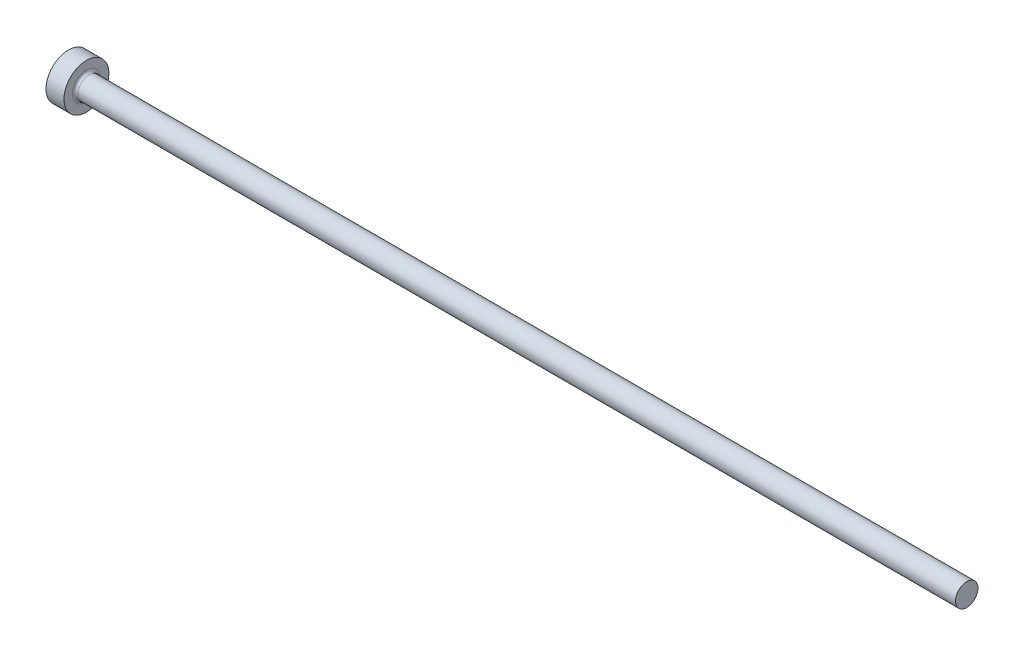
ISO-10303-21;
HEADER;
FILE_DESCRIPTION(('STEP AP214'),'2;1');
FILE_NAME('part.step','',(''),(''),'','','');
FILE_SCHEMA(('AUTOMOTIVE_DESIGN { 1 0 10303 214 1 1 1 1 }'));
ENDSEC;
DATA;
#1=APPLICATION_CONTEXT('core data for automotive mechanical design processes');
#2=APPLICATION_PROTOCOL_DEFINITION('international standard','automotive_design',2000,#1);
#3=PRODUCT_CONTEXT('',#1,'mechanical');
#4=PRODUCT('Part','Part','',(#3));
#5=PRODUCT_RELATED_PRODUCT_CATEGORY('part','',(#4));
#6=PRODUCT_DEFINITION_FORMATION('','',#4);
#7=PRODUCT_DEFINITION_CONTEXT('part definition',#1,'design');
#8=PRODUCT_DEFINITION('design','',#6,#7);
#9=PRODUCT_DEFINITION_SHAPE('','',#8);
#10=(LENGTH_UNIT() NAMED_UNIT(*) SI_UNIT(.MILLI.,.METRE.));
#11=(NAMED_UNIT(*) PLANE_ANGLE_UNIT() SI_UNIT($,.RADIAN.));
#12=(NAMED_UNIT(*) SI_UNIT($,.STERADIAN.) SOLID_ANGLE_UNIT());
#13=UNCERTAINTY_MEASURE_WITH_UNIT(LENGTH_MEASURE(1.E-05),#10,'distance_accuracy_value','');
#14=(GEOMETRIC_REPRESENTATION_CONTEXT(3) GLOBAL_UNCERTAINTY_ASSIGNED_CONTEXT((#13)) GLOBAL_UNIT_ASSIGNED_CONTEXT((#10,
#11,#12)) REPRESENTATION_CONTEXT('',''));
#15=CARTESIAN_POINT('',(0.,0.,0.));
#16=DIRECTION('',(0.,0.,1.));
#17=DIRECTION('',(1.,0.,0.));
#18=AXIS2_PLACEMENT_3D('',#15,#16,#17);
#19=CARTESIAN_POINT('',(0.,0.,0.));
#20=DIRECTION('',(-1.,0.,0.));
#21=DIRECTION('',(0.,-1.,0.));
#22=AXIS2_PLACEMENT_3D('',#19,#20,#21);
#23=PLANE('',#22);
#24=CARTESIAN_POINT('',(0.,0.,0.));
#25=DIRECTION('',(1.,0.,0.));
#26=DIRECTION('',(0.,1.,0.));
#27=AXIS2_PLACEMENT_3D('',#24,#25,#26);
#28=CIRCLE('',#27,2.5);
#29=CARTESIAN_POINT('',(0.,2.5,0.));
#30=VERTEX_POINT('',#29);
#31=EDGE_CURVE('E25',#30,#30,#28,.T.);
#32=ORIENTED_EDGE('',*,*,#31,.F.);
#33=EDGE_LOOP('',(#32));
#34=FACE_BOUND('',#33,.T.);
#35=ADVANCED_FACE('F14',(#34),#23,.T.);
#36=CARTESIAN_POINT('',(100.,0.,0.));
#37=DIRECTION('',(1.,0.,0.));
#38=DIRECTION('',(0.,1.,0.));
#39=AXIS2_PLACEMENT_3D('',#36,#37,#38);
#40=CYLINDRICAL_SURFACE('',#39,2.5);
#41=ORIENTED_EDGE('',*,*,#31,.T.);
#42=EDGE_LOOP('',(#41));
#43=FACE_BOUND('',#42,.T.);
#44=CARTESIAN_POINT('',(2.,0.,0.));
#45=DIRECTION('',(1.,0.,0.));
#46=DIRECTION('',(0.,1.,0.));
#47=AXIS2_PLACEMENT_3D('',#44,#45,#46);
#48=CIRCLE('',#47,2.5);
#49=CARTESIAN_POINT('',(2.,2.5,0.));
#50=VERTEX_POINT('',#49);
#51=EDGE_CURVE('E29',#50,#50,#48,.T.);
#52=ORIENTED_EDGE('',*,*,#51,.F.);
#53=EDGE_LOOP('',(#52));
#54=FACE_BOUND('',#53,.T.);
#55=ADVANCED_FACE('F51',(#43,#54),#40,.T.);
#56=CARTESIAN_POINT('',(2.,2.5,0.));
#57=DIRECTION('',(1.,0.,0.));
#58=DIRECTION('',(0.,1.,0.));
#59=AXIS2_PLACEMENT_3D('',#56,#57,#58);
#60=PLANE('',#59);
#61=CARTESIAN_POINT('',(2.,0.,0.));
#62=DIRECTION('',(1.,0.,0.));
#63=DIRECTION('',(0.,1.,0.));
#64=AXIS2_PLACEMENT_3D('',#61,#62,#63);
#65=CIRCLE('',#64,1.54999999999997);
#66=CARTESIAN_POINT('',(2.,1.54999999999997,0.));
#67=VERTEX_POINT('',#66);
#68=EDGE_CURVE('E9',#67,#67,#65,.F.);
#69=ORIENTED_EDGE('',*,*,#68,.T.);
#70=EDGE_LOOP('',(#69));
#71=FACE_BOUND('',#70,.T.);
#72=ORIENTED_EDGE('',*,*,#51,.T.);
#73=EDGE_LOOP('',(#72));
#74=FACE_BOUND('',#73,.T.);
#75=ADVANCED_FACE('F42',(#71,#74),#60,.T.);
#76=CARTESIAN_POINT('',(100.,0.,0.));
#77=DIRECTION('',(1.,0.,0.));
#78=DIRECTION('',(0.,1.,0.));
#79=AXIS2_PLACEMENT_3D('',#76,#77,#78);
#80=CYLINDRICAL_SURFACE('',#79,1.24999999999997);
#81=CARTESIAN_POINT('',(2.3,0.,0.));
#82=DIRECTION('',(1.,0.,0.));
#83=DIRECTION('',(0.,1.,0.));
#84=AXIS2_PLACEMENT_3D('',#81,#82,#83);
#85=CIRCLE('',#84,1.24999999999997);
#86=CARTESIAN_POINT('',(2.3,1.24999999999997,0.));
#87=VERTEX_POINT('',#86);
#88=EDGE_CURVE('E21',#87,#87,#85,.T.);
#89=ORIENTED_EDGE('',*,*,#88,.T.);
#90=EDGE_LOOP('',(#89));
#91=FACE_BOUND('',#90,.T.);
#92=CARTESIAN_POINT('',(100.,0.,0.));
#93=DIRECTION('',(1.,0.,0.));
#94=DIRECTION('',(0.,1.,0.));
#95=AXIS2_PLACEMENT_3D('',#92,#93,#94);
#96=CIRCLE('',#95,1.24999999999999);
#97=CARTESIAN_POINT('',(100.,1.24999999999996,0.));
#98=VERTEX_POINT('',#97);
#99=EDGE_CURVE('E34',#98,#98,#96,.T.);
#100=ORIENTED_EDGE('',*,*,#99,.F.);
#101=EDGE_LOOP('',(#100));
#102=FACE_BOUND('',#101,.T.);
#103=ADVANCED_FACE('F40',(#91,#102),#80,.T.);
#104=CARTESIAN_POINT('',(100.,1.24999999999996,0.));
#105=DIRECTION('',(1.,0.,0.));
#106=DIRECTION('',(0.,1.,0.));
#107=AXIS2_PLACEMENT_3D('',#104,#105,#106);
#108=PLANE('',#107);
#109=ORIENTED_EDGE('',*,*,#99,.T.);
#110=EDGE_LOOP('',(#109));
#111=FACE_BOUND('',#110,.T.);
#112=ADVANCED_FACE('F38',(#111),#108,.T.);
#113=CARTESIAN_POINT('',(2.3,0.,0.));
#114=DIRECTION('',(1.,0.,0.));
#115=DIRECTION('',(0.,1.,0.));
#116=AXIS2_PLACEMENT_3D('',#113,#114,#115);
#117=TOROIDAL_SURFACE('',#116,1.54999999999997,0.3);
#118=ORIENTED_EDGE('',*,*,#68,.F.);
#119=EDGE_LOOP('',(#118));
#120=FACE_BOUND('',#119,.T.);
#121=ORIENTED_EDGE('',*,*,#88,.F.);
#122=EDGE_LOOP('',(#121));
#123=FACE_BOUND('',#122,.T.);
#124=ADVANCED_FACE('F16',(#120,#123),#117,.F.);
#125=CLOSED_SHELL('',(#35,#55,#75,#103,#112,#124));
#126=MANIFOLD_SOLID_BREP('B1',#125);
#127=ADVANCED_BREP_SHAPE_REPRESENTATION('',(#18,#126),#14);
#128=SHAPE_DEFINITION_REPRESENTATION(#9,#127);
ENDSEC;
END-ISO-10303-21;
